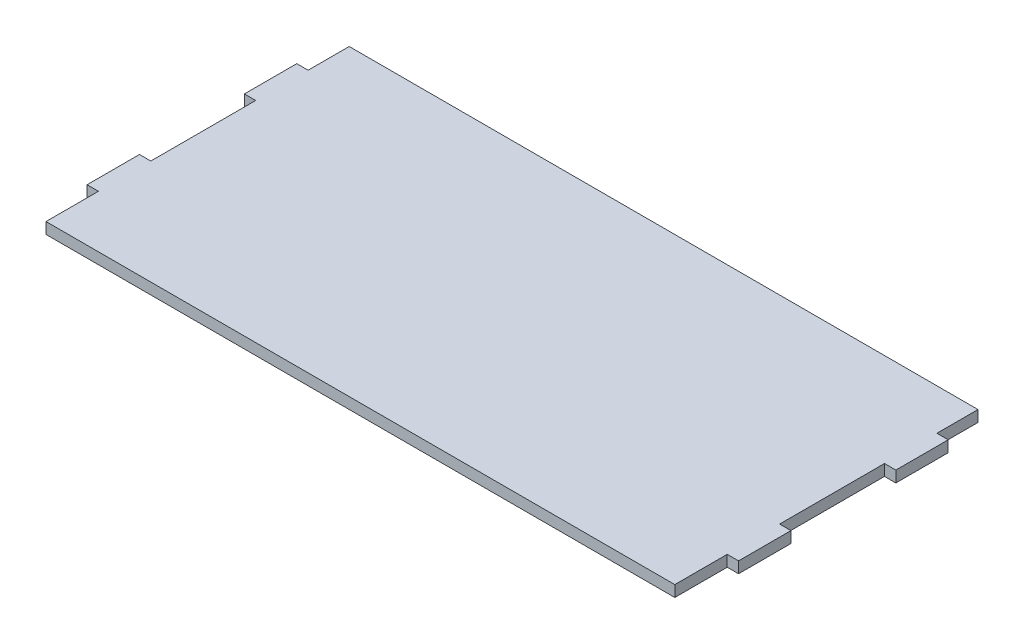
ISO-10303-21;
HEADER;
FILE_DESCRIPTION(('STEP AP214'),'2;1');
FILE_NAME('part.step','',(''),(''),'','','');
FILE_SCHEMA(('AUTOMOTIVE_DESIGN { 1 0 10303 214 1 1 1 1 }'));
ENDSEC;
DATA;
#1=APPLICATION_CONTEXT('core data for automotive mechanical design processes');
#2=APPLICATION_PROTOCOL_DEFINITION('international standard','automotive_design',2000,#1);
#3=PRODUCT_CONTEXT('',#1,'mechanical');
#4=PRODUCT('Part','Part','',(#3));
#5=PRODUCT_RELATED_PRODUCT_CATEGORY('part','',(#4));
#6=PRODUCT_DEFINITION_FORMATION('','',#4);
#7=PRODUCT_DEFINITION_CONTEXT('part definition',#1,'design');
#8=PRODUCT_DEFINITION('design','',#6,#7);
#9=PRODUCT_DEFINITION_SHAPE('','',#8);
#10=(LENGTH_UNIT() NAMED_UNIT(*) SI_UNIT(.MILLI.,.METRE.));
#11=(NAMED_UNIT(*) PLANE_ANGLE_UNIT() SI_UNIT($,.RADIAN.));
#12=(NAMED_UNIT(*) SI_UNIT($,.STERADIAN.) SOLID_ANGLE_UNIT());
#13=UNCERTAINTY_MEASURE_WITH_UNIT(LENGTH_MEASURE(1.E-05),#10,'distance_accuracy_value','');
#14=(GEOMETRIC_REPRESENTATION_CONTEXT(3) GLOBAL_UNCERTAINTY_ASSIGNED_CONTEXT((#13)) GLOBAL_UNIT_ASSIGNED_CONTEXT((#10,
#11,#12)) REPRESENTATION_CONTEXT('',''));
#15=CARTESIAN_POINT('',(0.,0.,0.));
#16=DIRECTION('',(0.,0.,1.));
#17=DIRECTION('',(1.,0.,0.));
#18=AXIS2_PLACEMENT_3D('',#15,#16,#17);
#19=CARTESIAN_POINT('',(0.332647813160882,16.30000042,-365.554762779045));
#20=DIRECTION('',(1.,0.,0.));
#21=DIRECTION('',(0.,0.,-1.));
#22=AXIS2_PLACEMENT_3D('',#19,#20,#21);
#23=PLANE('',#22);
#24=DIRECTION('',(0.,0.,1.));
#25=VECTOR('',#24,1.);
#26=CARTESIAN_POINT('',(0.332647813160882,0.,-365.554762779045));
#27=LINE('',#26,#25);
#28=CARTESIAN_POINT('',(0.332647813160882,0.,-365.554762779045));
#29=VERTEX_POINT('',#28);
#30=CARTESIAN_POINT('',(0.332647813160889,0.,-305.806810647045));
#31=VERTEX_POINT('',#30);
#32=EDGE_CURVE('E201',#29,#31,#27,.T.);
#33=ORIENTED_EDGE('',*,*,#32,.T.);
#34=DIRECTION('',(0.,-1.,0.));
#35=VECTOR('',#34,1.);
#36=CARTESIAN_POINT('',(0.332647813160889,16.30000042,-305.806810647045));
#37=LINE('',#36,#35);
#38=CARTESIAN_POINT('',(0.332647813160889,16.30000042,-305.806810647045));
#39=VERTEX_POINT('',#38);
#40=EDGE_CURVE('E11',#39,#31,#37,.T.);
#41=ORIENTED_EDGE('',*,*,#40,.F.);
#42=DIRECTION('',(0.,0.,1.));
#43=VECTOR('',#42,1.);
#44=CARTESIAN_POINT('',(0.332647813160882,16.30000042,-365.554762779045));
#45=LINE('',#44,#43);
#46=CARTESIAN_POINT('',(0.332647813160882,16.30000042,-365.554762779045));
#47=VERTEX_POINT('',#46);
#48=EDGE_CURVE('E239',#47,#39,#45,.T.);
#49=ORIENTED_EDGE('',*,*,#48,.F.);
#50=DIRECTION('',(0.,-1.,0.));
#51=VECTOR('',#50,1.);
#52=CARTESIAN_POINT('',(0.332647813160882,16.30000042,-365.554762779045));
#53=LINE('',#52,#51);
#54=EDGE_CURVE('E197',#47,#29,#53,.T.);
#55=ORIENTED_EDGE('',*,*,#54,.T.);
#56=EDGE_LOOP('',(#33,#41,#49,#55));
#57=FACE_BOUND('',#56,.T.);
#58=ADVANCED_FACE('F33',(#57),#23,.F.);
#59=CARTESIAN_POINT('',(0.332647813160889,16.30000042,-305.806810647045));
#60=DIRECTION('',(0.,0.,1.));
#61=DIRECTION('',(1.,0.,0.));
#62=AXIS2_PLACEMENT_3D('',#59,#60,#61);
#63=PLANE('',#62);
#64=DIRECTION('',(-1.,0.,0.));
#65=VECTOR('',#64,1.);
#66=CARTESIAN_POINT('',(0.332647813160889,0.,-305.806810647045));
#67=LINE('',#66,#65);
#68=CARTESIAN_POINT('',(-16.1451060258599,0.,-305.806810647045));
#69=VERTEX_POINT('',#68);
#70=EDGE_CURVE('E204',#31,#69,#67,.T.);
#71=ORIENTED_EDGE('',*,*,#70,.T.);
#72=DIRECTION('',(0.,-1.,0.));
#73=VECTOR('',#72,1.);
#74=CARTESIAN_POINT('',(-16.1451060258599,16.30000042,-305.806810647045));
#75=LINE('',#74,#73);
#76=CARTESIAN_POINT('',(-16.1451060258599,16.30000042,-305.806810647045));
#77=VERTEX_POINT('',#76);
#78=EDGE_CURVE('E41',#77,#69,#75,.T.);
#79=ORIENTED_EDGE('',*,*,#78,.F.);
#80=DIRECTION('',(-1.,0.,0.));
#81=VECTOR('',#80,1.);
#82=CARTESIAN_POINT('',(0.332647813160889,16.30000042,-305.806810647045));
#83=LINE('',#82,#81);
#84=EDGE_CURVE('E128',#39,#77,#83,.T.);
#85=ORIENTED_EDGE('',*,*,#84,.F.);
#86=ORIENTED_EDGE('',*,*,#40,.T.);
#87=EDGE_LOOP('',(#71,#79,#85,#86));
#88=FACE_BOUND('',#87,.T.);
#89=ADVANCED_FACE('F357',(#88),#63,.F.);
#90=CARTESIAN_POINT('',(-16.1451060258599,16.30000042,-305.806810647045));
#91=DIRECTION('',(1.,0.,0.));
#92=DIRECTION('',(0.,0.,-1.));
#93=AXIS2_PLACEMENT_3D('',#90,#91,#92);
#94=PLANE('',#93);
#95=DIRECTION('',(0.,0.,1.));
#96=VECTOR('',#95,1.);
#97=CARTESIAN_POINT('',(-16.1451060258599,0.,-305.806810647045));
#98=LINE('',#97,#96);
#99=CARTESIAN_POINT('',(-16.1451060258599,0.,-229.606810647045));
#100=VERTEX_POINT('',#99);
#101=EDGE_CURVE('E206',#69,#100,#98,.T.);
#102=ORIENTED_EDGE('',*,*,#101,.T.);
#103=DIRECTION('',(0.,-1.,0.));
#104=VECTOR('',#103,1.);
#105=CARTESIAN_POINT('',(-16.1451060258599,16.30000042,-229.606810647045));
#106=LINE('',#105,#104);
#107=CARTESIAN_POINT('',(-16.1451060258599,16.30000042,-229.606810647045));
#108=VERTEX_POINT('',#107);
#109=EDGE_CURVE('E282',#108,#100,#106,.T.);
#110=ORIENTED_EDGE('',*,*,#109,.F.);
#111=DIRECTION('',(0.,0.,1.));
#112=VECTOR('',#111,1.);
#113=CARTESIAN_POINT('',(-16.1451060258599,16.30000042,-305.806810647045));
#114=LINE('',#113,#112);
#115=EDGE_CURVE('E290',#77,#108,#114,.T.);
#116=ORIENTED_EDGE('',*,*,#115,.F.);
#117=ORIENTED_EDGE('',*,*,#78,.T.);
#118=EDGE_LOOP('',(#102,#110,#116,#117));
#119=FACE_BOUND('',#118,.T.);
#120=ADVANCED_FACE('F288',(#119),#94,.F.);
#121=CARTESIAN_POINT('',(-16.1451060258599,16.30000042,-229.606810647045));
#122=DIRECTION('',(0.,0.,-1.));
#123=DIRECTION('',(-1.,0.,0.));
#124=AXIS2_PLACEMENT_3D('',#121,#122,#123);
#125=PLANE('',#124);
#126=DIRECTION('',(1.,0.,0.));
#127=VECTOR('',#126,1.);
#128=CARTESIAN_POINT('',(-16.1451060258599,0.,-229.606810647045));
#129=LINE('',#128,#127);
#130=CARTESIAN_POINT('',(0.332647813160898,0.,-229.606810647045));
#131=VERTEX_POINT('',#130);
#132=EDGE_CURVE('E208',#100,#131,#129,.T.);
#133=ORIENTED_EDGE('',*,*,#132,.T.);
#134=DIRECTION('',(0.,-1.,0.));
#135=VECTOR('',#134,1.);
#136=CARTESIAN_POINT('',(0.332647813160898,16.30000042,-229.606810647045));
#137=LINE('',#136,#135);
#138=CARTESIAN_POINT('',(0.332647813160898,16.30000042,-229.606810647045));
#139=VERTEX_POINT('',#138);
#140=EDGE_CURVE('E279',#139,#131,#137,.T.);
#141=ORIENTED_EDGE('',*,*,#140,.F.);
#142=DIRECTION('',(1.,0.,0.));
#143=VECTOR('',#142,1.);
#144=CARTESIAN_POINT('',(-16.1451060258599,16.30000042,-229.606810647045));
#145=LINE('',#144,#143);
#146=EDGE_CURVE('E308',#108,#139,#145,.T.);
#147=ORIENTED_EDGE('',*,*,#146,.F.);
#148=ORIENTED_EDGE('',*,*,#109,.T.);
#149=EDGE_LOOP('',(#133,#141,#147,#148));
#150=FACE_BOUND('',#149,.T.);
#151=ADVANCED_FACE('F299',(#150),#125,.F.);
#152=CARTESIAN_POINT('',(0.332647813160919,16.30000042,-77.0721405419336));
#153=DIRECTION('',(1.,0.,0.));
#154=DIRECTION('',(0.,0.,-1.));
#155=AXIS2_PLACEMENT_3D('',#152,#153,#154);
#156=PLANE('',#155);
#157=DIRECTION('',(0.,0.,1.));
#158=VECTOR('',#157,1.);
#159=CARTESIAN_POINT('',(0.332647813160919,0.,-77.0721405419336));
#160=LINE('',#159,#158);
#161=CARTESIAN_POINT('',(0.332647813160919,0.,-77.0721405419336));
#162=VERTEX_POINT('',#161);
#163=EDGE_CURVE('E210',#131,#162,#160,.T.);
#164=ORIENTED_EDGE('',*,*,#163,.T.);
#165=DIRECTION('',(0.,-1.,0.));
#166=VECTOR('',#165,1.);
#167=CARTESIAN_POINT('',(0.332647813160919,16.30000042,-77.0721405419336));
#168=LINE('',#167,#166);
#169=CARTESIAN_POINT('',(0.332647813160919,16.30000042,-77.0721405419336));
#170=VERTEX_POINT('',#169);
#171=EDGE_CURVE('E276',#170,#162,#168,.T.);
#172=ORIENTED_EDGE('',*,*,#171,.F.);
#173=DIRECTION('',(0.,0.,1.));
#174=VECTOR('',#173,1.);
#175=CARTESIAN_POINT('',(0.332647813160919,16.30000042,-77.0721405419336));
#176=LINE('',#175,#174);
#177=EDGE_CURVE('E305',#139,#170,#176,.T.);
#178=ORIENTED_EDGE('',*,*,#177,.F.);
#179=ORIENTED_EDGE('',*,*,#140,.T.);
#180=EDGE_LOOP('',(#164,#172,#178,#179));
#181=FACE_BOUND('',#180,.T.);
#182=ADVANCED_FACE('F303',(#181),#156,.F.);
#183=CARTESIAN_POINT('',(-16.1495139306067,16.30000042,-77.0721405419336));
#184=DIRECTION('',(0.,0.,1.));
#185=DIRECTION('',(1.,0.,0.));
#186=AXIS2_PLACEMENT_3D('',#183,#184,#185);
#187=PLANE('',#186);
#188=DIRECTION('',(-1.,0.,0.));
#189=VECTOR('',#188,1.);
#190=CARTESIAN_POINT('',(-16.1495139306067,0.,-77.0721405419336));
#191=LINE('',#190,#189);
#192=CARTESIAN_POINT('',(-16.1495139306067,0.,-77.0721405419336));
#193=VERTEX_POINT('',#192);
#194=EDGE_CURVE('E212',#162,#193,#191,.T.);
#195=ORIENTED_EDGE('',*,*,#194,.T.);
#196=DIRECTION('',(0.,-1.,0.));
#197=VECTOR('',#196,1.);
#198=CARTESIAN_POINT('',(-16.1495139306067,16.30000042,-77.0721405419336));
#199=LINE('',#198,#197);
#200=CARTESIAN_POINT('',(-16.1495139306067,16.30000042,-77.0721405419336));
#201=VERTEX_POINT('',#200);
#202=EDGE_CURVE('E273',#201,#193,#199,.T.);
#203=ORIENTED_EDGE('',*,*,#202,.F.);
#204=DIRECTION('',(-1.,0.,0.));
#205=VECTOR('',#204,1.);
#206=CARTESIAN_POINT('',(-16.1495139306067,16.30000042,-77.0721405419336));
#207=LINE('',#206,#205);
#208=EDGE_CURVE('E307',#170,#201,#207,.T.);
#209=ORIENTED_EDGE('',*,*,#208,.F.);
#210=ORIENTED_EDGE('',*,*,#171,.T.);
#211=EDGE_LOOP('',(#195,#203,#209,#210));
#212=FACE_BOUND('',#211,.T.);
#213=ADVANCED_FACE('F370',(#212),#187,.F.);
#214=CARTESIAN_POINT('',(-16.1495139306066,16.30000042,-0.872140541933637));
#215=DIRECTION('',(1.,0.,0.));
#216=DIRECTION('',(0.,0.,-1.));
#217=AXIS2_PLACEMENT_3D('',#214,#215,#216);
#218=PLANE('',#217);
#219=DIRECTION('',(0.,0.,1.));
#220=VECTOR('',#219,1.);
#221=CARTESIAN_POINT('',(-16.1495139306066,0.,-0.872140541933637));
#222=LINE('',#221,#220);
#223=CARTESIAN_POINT('',(-16.1495139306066,0.,-0.872140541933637));
#224=VERTEX_POINT('',#223);
#225=EDGE_CURVE('E214',#193,#224,#222,.T.);
#226=ORIENTED_EDGE('',*,*,#225,.T.);
#227=DIRECTION('',(0.,-1.,0.));
#228=VECTOR('',#227,1.);
#229=CARTESIAN_POINT('',(-16.1495139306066,16.30000042,-0.872140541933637));
#230=LINE('',#229,#228);
#231=CARTESIAN_POINT('',(-16.1495139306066,16.30000042,-0.872140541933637));
#232=VERTEX_POINT('',#231);
#233=EDGE_CURVE('E270',#232,#224,#230,.T.);
#234=ORIENTED_EDGE('',*,*,#233,.F.);
#235=DIRECTION('',(0.,0.,1.));
#236=VECTOR('',#235,1.);
#237=CARTESIAN_POINT('',(-16.1495139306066,16.30000042,-0.872140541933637));
#238=LINE('',#237,#236);
#239=EDGE_CURVE('E310',#201,#232,#238,.T.);
#240=ORIENTED_EDGE('',*,*,#239,.F.);
#241=ORIENTED_EDGE('',*,*,#202,.T.);
#242=EDGE_LOOP('',(#226,#234,#240,#241));
#243=FACE_BOUND('',#242,.T.);
#244=ADVANCED_FACE('F373',(#243),#218,.F.);
#245=CARTESIAN_POINT('',(0.332647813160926,16.30000042,-0.872140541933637));
#246=DIRECTION('',(0.,0.,-1.));
#247=DIRECTION('',(-1.,0.,0.));
#248=AXIS2_PLACEMENT_3D('',#245,#246,#247);
#249=PLANE('',#248);
#250=DIRECTION('',(1.,0.,0.));
#251=VECTOR('',#250,1.);
#252=CARTESIAN_POINT('',(0.332647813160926,0.,-0.872140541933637));
#253=LINE('',#252,#251);
#254=CARTESIAN_POINT('',(0.332647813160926,0.,-0.872140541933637));
#255=VERTEX_POINT('',#254);
#256=EDGE_CURVE('E216',#224,#255,#253,.T.);
#257=ORIENTED_EDGE('',*,*,#256,.T.);
#258=DIRECTION('',(0.,-1.,0.));
#259=VECTOR('',#258,1.);
#260=CARTESIAN_POINT('',(0.332647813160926,16.30000042,-0.872140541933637));
#261=LINE('',#260,#259);
#262=CARTESIAN_POINT('',(0.332647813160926,16.30000042,-0.872140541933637));
#263=VERTEX_POINT('',#262);
#264=EDGE_CURVE('E267',#263,#255,#261,.T.);
#265=ORIENTED_EDGE('',*,*,#264,.F.);
#266=DIRECTION('',(1.,0.,0.));
#267=VECTOR('',#266,1.);
#268=CARTESIAN_POINT('',(0.332647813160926,16.30000042,-0.872140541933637));
#269=LINE('',#268,#267);
#270=EDGE_CURVE('E316',#232,#263,#269,.T.);
#271=ORIENTED_EDGE('',*,*,#270,.F.);
#272=ORIENTED_EDGE('',*,*,#233,.T.);
#273=EDGE_LOOP('',(#257,#265,#271,#272));
#274=FACE_BOUND('',#273,.T.);
#275=ADVANCED_FACE('F377',(#274),#249,.F.);
#276=CARTESIAN_POINT('',(0.332647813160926,16.30000042,-0.872140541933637));
#277=DIRECTION('',(1.,0.,0.));
#278=DIRECTION('',(0.,0.,-1.));
#279=AXIS2_PLACEMENT_3D('',#276,#277,#278);
#280=PLANE('',#279);
#281=DIRECTION('',(0.,0.,1.));
#282=VECTOR('',#281,1.);
#283=CARTESIAN_POINT('',(0.332647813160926,0.,-0.872140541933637));
#284=LINE('',#283,#282);
#285=CARTESIAN_POINT('',(0.332647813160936,0.,75.3452367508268));
#286=VERTEX_POINT('',#285);
#287=EDGE_CURVE('E218',#255,#286,#284,.T.);
#288=ORIENTED_EDGE('',*,*,#287,.T.);
#289=DIRECTION('',(0.,-1.,0.));
#290=VECTOR('',#289,1.);
#291=CARTESIAN_POINT('',(0.332647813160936,16.30000042,75.3452367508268));
#292=LINE('',#291,#290);
#293=CARTESIAN_POINT('',(0.332647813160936,16.30000042,75.3452367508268));
#294=VERTEX_POINT('',#293);
#295=EDGE_CURVE('E264',#294,#286,#292,.T.);
#296=ORIENTED_EDGE('',*,*,#295,.F.);
#297=DIRECTION('',(0.,0.,1.));
#298=VECTOR('',#297,1.);
#299=CARTESIAN_POINT('',(0.332647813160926,16.30000042,-0.872140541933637));
#300=LINE('',#299,#298);
#301=EDGE_CURVE('E318',#263,#294,#300,.T.);
#302=ORIENTED_EDGE('',*,*,#301,.F.);
#303=ORIENTED_EDGE('',*,*,#264,.T.);
#304=EDGE_LOOP('',(#288,#296,#302,#303));
#305=FACE_BOUND('',#304,.T.);
#306=ADVANCED_FACE('F381',(#305),#280,.F.);
#307=CARTESIAN_POINT('',(0.332647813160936,16.30000042,75.3452367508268));
#308=DIRECTION('',(0.,0.,-1.));
#309=DIRECTION('',(-1.,0.,0.));
#310=AXIS2_PLACEMENT_3D('',#307,#308,#309);
#311=PLANE('',#310);
#312=DIRECTION('',(1.,0.,0.));
#313=VECTOR('',#312,1.);
#314=CARTESIAN_POINT('',(0.332647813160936,0.,75.3452367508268));
#315=LINE('',#314,#313);
#316=CARTESIAN_POINT('',(914.732647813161,0.,75.3452367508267));
#317=VERTEX_POINT('',#316);
#318=EDGE_CURVE('E220',#286,#317,#315,.T.);
#319=ORIENTED_EDGE('',*,*,#318,.T.);
#320=DIRECTION('',(0.,-1.,0.));
#321=VECTOR('',#320,1.);
#322=CARTESIAN_POINT('',(914.732647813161,16.30000042,75.3452367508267));
#323=LINE('',#322,#321);
#324=CARTESIAN_POINT('',(914.732647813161,16.30000042,75.3452367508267));
#325=VERTEX_POINT('',#324);
#326=EDGE_CURVE('E261',#325,#317,#323,.T.);
#327=ORIENTED_EDGE('',*,*,#326,.F.);
#328=DIRECTION('',(1.,0.,0.));
#329=VECTOR('',#328,1.);
#330=CARTESIAN_POINT('',(0.332647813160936,16.30000042,75.3452367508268));
#331=LINE('',#330,#329);
#332=EDGE_CURVE('E320',#294,#325,#331,.T.);
#333=ORIENTED_EDGE('',*,*,#332,.F.);
#334=ORIENTED_EDGE('',*,*,#295,.T.);
#335=EDGE_LOOP('',(#319,#327,#333,#334));
#336=FACE_BOUND('',#335,.T.);
#337=ADVANCED_FACE('F385',(#336),#311,.F.);
#338=CARTESIAN_POINT('',(914.732647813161,16.30000042,-0.872140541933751));
#339=DIRECTION('',(-1.,0.,0.));
#340=DIRECTION('',(0.,0.,1.));
#341=AXIS2_PLACEMENT_3D('',#338,#339,#340);
#342=PLANE('',#341);
#343=DIRECTION('',(0.,0.,-1.));
#344=VECTOR('',#343,1.);
#345=CARTESIAN_POINT('',(914.732647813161,0.,-0.872140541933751));
#346=LINE('',#345,#344);
#347=CARTESIAN_POINT('',(914.732647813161,0.,-0.872140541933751));
#348=VERTEX_POINT('',#347);
#349=EDGE_CURVE('E222',#317,#348,#346,.T.);
#350=ORIENTED_EDGE('',*,*,#349,.T.);
#351=DIRECTION('',(0.,-1.,0.));
#352=VECTOR('',#351,1.);
#353=CARTESIAN_POINT('',(914.732647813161,16.30000042,-0.872140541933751));
#354=LINE('',#353,#352);
#355=CARTESIAN_POINT('',(914.732647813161,16.30000042,-0.872140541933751));
#356=VERTEX_POINT('',#355);
#357=EDGE_CURVE('E258',#356,#348,#354,.T.);
#358=ORIENTED_EDGE('',*,*,#357,.F.);
#359=DIRECTION('',(0.,0.,-1.));
#360=VECTOR('',#359,1.);
#361=CARTESIAN_POINT('',(914.732647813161,16.30000042,-0.872140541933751));
#362=LINE('',#361,#360);
#363=EDGE_CURVE('E322',#325,#356,#362,.T.);
#364=ORIENTED_EDGE('',*,*,#363,.F.);
#365=ORIENTED_EDGE('',*,*,#326,.T.);
#366=EDGE_LOOP('',(#350,#358,#364,#365));
#367=FACE_BOUND('',#366,.T.);
#368=ADVANCED_FACE('F389',(#367),#342,.F.);
#369=CARTESIAN_POINT('',(914.732647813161,16.30000042,-0.872140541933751));
#370=DIRECTION('',(0.,0.,-1.));
#371=DIRECTION('',(-1.,0.,0.));
#372=AXIS2_PLACEMENT_3D('',#369,#370,#371);
#373=PLANE('',#372);
#374=DIRECTION('',(1.,0.,0.));
#375=VECTOR('',#374,1.);
#376=CARTESIAN_POINT('',(914.732647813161,0.,-0.872140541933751));
#377=LINE('',#376,#375);
#378=CARTESIAN_POINT('',(931.214809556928,0.,-0.872140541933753));
#379=VERTEX_POINT('',#378);
#380=EDGE_CURVE('E224',#348,#379,#377,.T.);
#381=ORIENTED_EDGE('',*,*,#380,.T.);
#382=DIRECTION('',(0.,-1.,0.));
#383=VECTOR('',#382,1.);
#384=CARTESIAN_POINT('',(931.214809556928,16.30000042,-0.872140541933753));
#385=LINE('',#384,#383);
#386=CARTESIAN_POINT('',(931.214809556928,16.30000042,-0.872140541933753));
#387=VERTEX_POINT('',#386);
#388=EDGE_CURVE('E255',#387,#379,#385,.T.);
#389=ORIENTED_EDGE('',*,*,#388,.F.);
#390=DIRECTION('',(1.,0.,0.));
#391=VECTOR('',#390,1.);
#392=CARTESIAN_POINT('',(914.732647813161,16.30000042,-0.872140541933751));
#393=LINE('',#392,#391);
#394=EDGE_CURVE('E324',#356,#387,#393,.T.);
#395=ORIENTED_EDGE('',*,*,#394,.F.);
#396=ORIENTED_EDGE('',*,*,#357,.T.);
#397=EDGE_LOOP('',(#381,#389,#395,#396));
#398=FACE_BOUND('',#397,.T.);
#399=ADVANCED_FACE('F393',(#398),#373,.F.);
#400=CARTESIAN_POINT('',(931.214809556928,16.30000042,-0.872140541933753));
#401=DIRECTION('',(-1.,0.,0.));
#402=DIRECTION('',(0.,0.,1.));
#403=AXIS2_PLACEMENT_3D('',#400,#401,#402);
#404=PLANE('',#403);
#405=DIRECTION('',(0.,0.,-1.));
#406=VECTOR('',#405,1.);
#407=CARTESIAN_POINT('',(931.214809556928,0.,-0.872140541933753));
#408=LINE('',#407,#406);
#409=CARTESIAN_POINT('',(931.214809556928,0.,-77.0721405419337));
#410=VERTEX_POINT('',#409);
#411=EDGE_CURVE('E226',#379,#410,#408,.T.);
#412=ORIENTED_EDGE('',*,*,#411,.T.);
#413=DIRECTION('',(0.,-1.,0.));
#414=VECTOR('',#413,1.);
#415=CARTESIAN_POINT('',(931.214809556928,16.30000042,-77.0721405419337));
#416=LINE('',#415,#414);
#417=CARTESIAN_POINT('',(931.214809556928,16.30000042,-77.0721405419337));
#418=VERTEX_POINT('',#417);
#419=EDGE_CURVE('E252',#418,#410,#416,.T.);
#420=ORIENTED_EDGE('',*,*,#419,.F.);
#421=DIRECTION('',(0.,0.,-1.));
#422=VECTOR('',#421,1.);
#423=CARTESIAN_POINT('',(931.214809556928,16.30000042,-0.872140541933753));
#424=LINE('',#423,#422);
#425=EDGE_CURVE('E326',#387,#418,#424,.T.);
#426=ORIENTED_EDGE('',*,*,#425,.F.);
#427=ORIENTED_EDGE('',*,*,#388,.T.);
#428=EDGE_LOOP('',(#412,#420,#426,#427));
#429=FACE_BOUND('',#428,.T.);
#430=ADVANCED_FACE('F397',(#429),#404,.F.);
#431=CARTESIAN_POINT('',(931.214809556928,16.30000042,-77.0721405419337));
#432=DIRECTION('',(0.,0.,1.));
#433=DIRECTION('',(1.,0.,0.));
#434=AXIS2_PLACEMENT_3D('',#431,#432,#433);
#435=PLANE('',#434);
#436=DIRECTION('',(-1.,0.,0.));
#437=VECTOR('',#436,1.);
#438=CARTESIAN_POINT('',(931.214809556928,0.,-77.0721405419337));
#439=LINE('',#438,#437);
#440=CARTESIAN_POINT('',(914.732647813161,0.,-77.0721405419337));
#441=VERTEX_POINT('',#440);
#442=EDGE_CURVE('E228',#410,#441,#439,.T.);
#443=ORIENTED_EDGE('',*,*,#442,.T.);
#444=DIRECTION('',(0.,-1.,0.));
#445=VECTOR('',#444,1.);
#446=CARTESIAN_POINT('',(914.732647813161,16.30000042,-77.0721405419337));
#447=LINE('',#446,#445);
#448=CARTESIAN_POINT('',(914.732647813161,16.30000042,-77.0721405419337));
#449=VERTEX_POINT('',#448);
#450=EDGE_CURVE('E249',#449,#441,#447,.T.);
#451=ORIENTED_EDGE('',*,*,#450,.F.);
#452=DIRECTION('',(-1.,0.,0.));
#453=VECTOR('',#452,1.);
#454=CARTESIAN_POINT('',(931.214809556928,16.30000042,-77.0721405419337));
#455=LINE('',#454,#453);
#456=EDGE_CURVE('E328',#418,#449,#455,.T.);
#457=ORIENTED_EDGE('',*,*,#456,.F.);
#458=ORIENTED_EDGE('',*,*,#419,.T.);
#459=EDGE_LOOP('',(#443,#451,#457,#458));
#460=FACE_BOUND('',#459,.T.);
#461=ADVANCED_FACE('F401',(#460),#435,.F.);
#462=CARTESIAN_POINT('',(914.732647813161,16.30000042,-229.606810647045));
#463=DIRECTION('',(-1.,0.,0.));
#464=DIRECTION('',(0.,0.,1.));
#465=AXIS2_PLACEMENT_3D('',#462,#463,#464);
#466=PLANE('',#465);
#467=DIRECTION('',(0.,0.,-1.));
#468=VECTOR('',#467,1.);
#469=CARTESIAN_POINT('',(914.732647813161,0.,-229.606810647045));
#470=LINE('',#469,#468);
#471=CARTESIAN_POINT('',(914.732647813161,0.,-229.606810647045));
#472=VERTEX_POINT('',#471);
#473=EDGE_CURVE('E230',#441,#472,#470,.T.);
#474=ORIENTED_EDGE('',*,*,#473,.T.);
#475=DIRECTION('',(0.,-1.,0.));
#476=VECTOR('',#475,1.);
#477=CARTESIAN_POINT('',(914.732647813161,16.30000042,-229.606810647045));
#478=LINE('',#477,#476);
#479=CARTESIAN_POINT('',(914.732647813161,16.30000042,-229.606810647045));
#480=VERTEX_POINT('',#479);
#481=EDGE_CURVE('E246',#480,#472,#478,.T.);
#482=ORIENTED_EDGE('',*,*,#481,.F.);
#483=DIRECTION('',(0.,0.,-1.));
#484=VECTOR('',#483,1.);
#485=CARTESIAN_POINT('',(914.732647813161,16.30000042,-229.606810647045));
#486=LINE('',#485,#484);
#487=EDGE_CURVE('E330',#449,#480,#486,.T.);
#488=ORIENTED_EDGE('',*,*,#487,.F.);
#489=ORIENTED_EDGE('',*,*,#450,.T.);
#490=EDGE_LOOP('',(#474,#482,#488,#489));
#491=FACE_BOUND('',#490,.T.);
#492=ADVANCED_FACE('F405',(#491),#466,.F.);
#493=CARTESIAN_POINT('',(931.210401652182,16.30000042,-229.606810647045));
#494=DIRECTION('',(0.,0.,-1.));
#495=DIRECTION('',(-1.,0.,0.));
#496=AXIS2_PLACEMENT_3D('',#493,#494,#495);
#497=PLANE('',#496);
#498=DIRECTION('',(1.,0.,0.));
#499=VECTOR('',#498,1.);
#500=CARTESIAN_POINT('',(931.210401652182,0.,-229.606810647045));
#501=LINE('',#500,#499);
#502=CARTESIAN_POINT('',(931.210401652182,0.,-229.606810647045));
#503=VERTEX_POINT('',#502);
#504=EDGE_CURVE('E232',#472,#503,#501,.T.);
#505=ORIENTED_EDGE('',*,*,#504,.T.);
#506=DIRECTION('',(0.,-1.,0.));
#507=VECTOR('',#506,1.);
#508=CARTESIAN_POINT('',(931.210401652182,16.30000042,-229.606810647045));
#509=LINE('',#508,#507);
#510=CARTESIAN_POINT('',(931.210401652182,16.30000042,-229.606810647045));
#511=VERTEX_POINT('',#510);
#512=EDGE_CURVE('E243',#511,#503,#509,.T.);
#513=ORIENTED_EDGE('',*,*,#512,.F.);
#514=DIRECTION('',(1.,0.,0.));
#515=VECTOR('',#514,1.);
#516=CARTESIAN_POINT('',(931.210401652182,16.30000042,-229.606810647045));
#517=LINE('',#516,#515);
#518=EDGE_CURVE('E332',#480,#511,#517,.T.);
#519=ORIENTED_EDGE('',*,*,#518,.F.);
#520=ORIENTED_EDGE('',*,*,#481,.T.);
#521=EDGE_LOOP('',(#505,#513,#519,#520));
#522=FACE_BOUND('',#521,.T.);
#523=ADVANCED_FACE('F338',(#522),#497,.F.);
#524=CARTESIAN_POINT('',(931.210401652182,16.30000042,-305.806810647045));
#525=DIRECTION('',(-1.,0.,0.));
#526=DIRECTION('',(0.,0.,1.));
#527=AXIS2_PLACEMENT_3D('',#524,#525,#526);
#528=PLANE('',#527);
#529=DIRECTION('',(0.,0.,-1.));
#530=VECTOR('',#529,1.);
#531=CARTESIAN_POINT('',(931.210401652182,0.,-305.806810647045));
#532=LINE('',#531,#530);
#533=CARTESIAN_POINT('',(931.210401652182,0.,-305.806810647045));
#534=VERTEX_POINT('',#533);
#535=EDGE_CURVE('E234',#503,#534,#532,.T.);
#536=ORIENTED_EDGE('',*,*,#535,.T.);
#537=DIRECTION('',(0.,-1.,0.));
#538=VECTOR('',#537,1.);
#539=CARTESIAN_POINT('',(931.210401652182,16.30000042,-305.806810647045));
#540=LINE('',#539,#538);
#541=CARTESIAN_POINT('',(931.210401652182,16.30000042,-305.806810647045));
#542=VERTEX_POINT('',#541);
#543=EDGE_CURVE('E192',#542,#534,#540,.T.);
#544=ORIENTED_EDGE('',*,*,#543,.F.);
#545=DIRECTION('',(0.,0.,-1.));
#546=VECTOR('',#545,1.);
#547=CARTESIAN_POINT('',(931.210401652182,16.30000042,-305.806810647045));
#548=LINE('',#547,#546);
#549=EDGE_CURVE('E183',#511,#542,#548,.T.);
#550=ORIENTED_EDGE('',*,*,#549,.F.);
#551=ORIENTED_EDGE('',*,*,#512,.T.);
#552=EDGE_LOOP('',(#536,#544,#550,#551));
#553=FACE_BOUND('',#552,.T.);
#554=ADVANCED_FACE('F342',(#553),#528,.F.);
#555=CARTESIAN_POINT('',(914.732647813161,16.30000042,-305.806810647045));
#556=DIRECTION('',(0.,0.,1.));
#557=DIRECTION('',(1.,0.,0.));
#558=AXIS2_PLACEMENT_3D('',#555,#556,#557);
#559=PLANE('',#558);
#560=DIRECTION('',(-1.,0.,0.));
#561=VECTOR('',#560,1.);
#562=CARTESIAN_POINT('',(914.732647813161,0.,-305.806810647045));
#563=LINE('',#562,#561);
#564=CARTESIAN_POINT('',(914.732647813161,0.,-305.806810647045));
#565=VERTEX_POINT('',#564);
#566=EDGE_CURVE('E191',#534,#565,#563,.T.);
#567=ORIENTED_EDGE('',*,*,#566,.T.);
#568=DIRECTION('',(0.,-1.,0.));
#569=VECTOR('',#568,1.);
#570=CARTESIAN_POINT('',(914.732647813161,16.30000042,-305.806810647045));
#571=LINE('',#570,#569);
#572=CARTESIAN_POINT('',(914.732647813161,16.30000042,-305.806810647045));
#573=VERTEX_POINT('',#572);
#574=EDGE_CURVE('E188',#573,#565,#571,.T.);
#575=ORIENTED_EDGE('',*,*,#574,.F.);
#576=DIRECTION('',(-1.,0.,0.));
#577=VECTOR('',#576,1.);
#578=CARTESIAN_POINT('',(914.732647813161,16.30000042,-305.806810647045));
#579=LINE('',#578,#577);
#580=EDGE_CURVE('E177',#542,#573,#579,.T.);
#581=ORIENTED_EDGE('',*,*,#580,.F.);
#582=ORIENTED_EDGE('',*,*,#543,.T.);
#583=EDGE_LOOP('',(#567,#575,#581,#582));
#584=FACE_BOUND('',#583,.T.);
#585=ADVANCED_FACE('F189',(#584),#559,.F.);
#586=CARTESIAN_POINT('',(914.732647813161,16.30000042,-365.554762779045));
#587=DIRECTION('',(-1.,0.,0.));
#588=DIRECTION('',(0.,0.,1.));
#589=AXIS2_PLACEMENT_3D('',#586,#587,#588);
#590=PLANE('',#589);
#591=DIRECTION('',(0.,0.,-1.));
#592=VECTOR('',#591,1.);
#593=CARTESIAN_POINT('',(914.732647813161,0.,-365.554762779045));
#594=LINE('',#593,#592);
#595=CARTESIAN_POINT('',(914.732647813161,0.,-365.554762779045));
#596=VERTEX_POINT('',#595);
#597=EDGE_CURVE('E114',#565,#596,#594,.T.);
#598=ORIENTED_EDGE('',*,*,#597,.T.);
#599=DIRECTION('',(0.,-1.,0.));
#600=VECTOR('',#599,1.);
#601=CARTESIAN_POINT('',(914.732647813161,16.30000042,-365.554762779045));
#602=LINE('',#601,#600);
#603=CARTESIAN_POINT('',(914.732647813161,16.30000042,-365.554762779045));
#604=VERTEX_POINT('',#603);
#605=EDGE_CURVE('E193',#604,#596,#602,.T.);
#606=ORIENTED_EDGE('',*,*,#605,.F.);
#607=DIRECTION('',(0.,0.,-1.));
#608=VECTOR('',#607,1.);
#609=CARTESIAN_POINT('',(914.732647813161,16.30000042,-365.554762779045));
#610=LINE('',#609,#608);
#611=EDGE_CURVE('E181',#573,#604,#610,.T.);
#612=ORIENTED_EDGE('',*,*,#611,.F.);
#613=ORIENTED_EDGE('',*,*,#574,.T.);
#614=EDGE_LOOP('',(#598,#606,#612,#613));
#615=FACE_BOUND('',#614,.T.);
#616=ADVANCED_FACE('F195',(#615),#590,.F.);
#617=CARTESIAN_POINT('',(0.332647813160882,16.30000042,-365.554762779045));
#618=DIRECTION('',(0.,0.,1.));
#619=DIRECTION('',(1.,0.,0.));
#620=AXIS2_PLACEMENT_3D('',#617,#618,#619);
#621=PLANE('',#620);
#622=DIRECTION('',(-1.,0.,0.));
#623=VECTOR('',#622,1.);
#624=CARTESIAN_POINT('',(0.332647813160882,0.,-365.554762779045));
#625=LINE('',#624,#623);
#626=EDGE_CURVE('E120',#596,#29,#625,.T.);
#627=ORIENTED_EDGE('',*,*,#626,.T.);
#628=ORIENTED_EDGE('',*,*,#54,.F.);
#629=DIRECTION('',(-1.,0.,0.));
#630=VECTOR('',#629,1.);
#631=CARTESIAN_POINT('',(0.332647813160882,16.30000042,-365.554762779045));
#632=LINE('',#631,#630);
#633=EDGE_CURVE('E49',#604,#47,#632,.T.);
#634=ORIENTED_EDGE('',*,*,#633,.F.);
#635=ORIENTED_EDGE('',*,*,#605,.T.);
#636=EDGE_LOOP('',(#627,#628,#634,#635));
#637=FACE_BOUND('',#636,.T.);
#638=ADVANCED_FACE('F346',(#637),#621,.F.);
#639=CARTESIAN_POINT('',(0.,16.30000042,0.));
#640=DIRECTION('',(0.,-1.,0.));
#641=DIRECTION('',(0.,0.,-1.));
#642=AXIS2_PLACEMENT_3D('',#639,#640,#641);
#643=PLANE('',#642);
#644=ORIENTED_EDGE('',*,*,#48,.T.);
#645=ORIENTED_EDGE('',*,*,#84,.T.);
#646=ORIENTED_EDGE('',*,*,#115,.T.);
#647=ORIENTED_EDGE('',*,*,#146,.T.);
#648=ORIENTED_EDGE('',*,*,#177,.T.);
#649=ORIENTED_EDGE('',*,*,#208,.T.);
#650=ORIENTED_EDGE('',*,*,#239,.T.);
#651=ORIENTED_EDGE('',*,*,#270,.T.);
#652=ORIENTED_EDGE('',*,*,#301,.T.);
#653=ORIENTED_EDGE('',*,*,#332,.T.);
#654=ORIENTED_EDGE('',*,*,#363,.T.);
#655=ORIENTED_EDGE('',*,*,#394,.T.);
#656=ORIENTED_EDGE('',*,*,#425,.T.);
#657=ORIENTED_EDGE('',*,*,#456,.T.);
#658=ORIENTED_EDGE('',*,*,#487,.T.);
#659=ORIENTED_EDGE('',*,*,#518,.T.);
#660=ORIENTED_EDGE('',*,*,#549,.T.);
#661=ORIENTED_EDGE('',*,*,#580,.T.);
#662=ORIENTED_EDGE('',*,*,#611,.T.);
#663=ORIENTED_EDGE('',*,*,#633,.T.);
#664=EDGE_LOOP('',(#644,#645,#646,#647,#648,#649,#650,#651,#652,#653,#654,#655,#656,#657,#658,
#659,#660,#661,#662,#663));
#665=FACE_BOUND('',#664,.T.);
#666=ADVANCED_FACE('F179',(#665),#643,.F.);
#667=CARTESIAN_POINT('',(0.,0.,0.));
#668=DIRECTION('',(0.,-1.,0.));
#669=DIRECTION('',(0.,0.,-1.));
#670=AXIS2_PLACEMENT_3D('',#667,#668,#669);
#671=PLANE('',#670);
#672=ORIENTED_EDGE('',*,*,#32,.F.);
#673=ORIENTED_EDGE('',*,*,#626,.F.);
#674=ORIENTED_EDGE('',*,*,#597,.F.);
#675=ORIENTED_EDGE('',*,*,#566,.F.);
#676=ORIENTED_EDGE('',*,*,#535,.F.);
#677=ORIENTED_EDGE('',*,*,#504,.F.);
#678=ORIENTED_EDGE('',*,*,#473,.F.);
#679=ORIENTED_EDGE('',*,*,#442,.F.);
#680=ORIENTED_EDGE('',*,*,#411,.F.);
#681=ORIENTED_EDGE('',*,*,#380,.F.);
#682=ORIENTED_EDGE('',*,*,#349,.F.);
#683=ORIENTED_EDGE('',*,*,#318,.F.);
#684=ORIENTED_EDGE('',*,*,#287,.F.);
#685=ORIENTED_EDGE('',*,*,#256,.F.);
#686=ORIENTED_EDGE('',*,*,#225,.F.);
#687=ORIENTED_EDGE('',*,*,#194,.F.);
#688=ORIENTED_EDGE('',*,*,#163,.F.);
#689=ORIENTED_EDGE('',*,*,#132,.F.);
#690=ORIENTED_EDGE('',*,*,#101,.F.);
#691=ORIENTED_EDGE('',*,*,#70,.F.);
#692=EDGE_LOOP('',(#672,#673,#674,#675,#676,#677,#678,#679,#680,#681,#682,#683,#684,#685,#686,
#687,#688,#689,#690,#691));
#693=FACE_BOUND('',#692,.T.);
#694=ADVANCED_FACE('F294',(#693),#671,.T.);
#695=CLOSED_SHELL('',(#58,#89,#120,#151,#182,#213,#244,#275,#306,#337,#368,#399,#430,#461,#492,
#523,#554,#585,#616,#638,#666,#694));
#696=MANIFOLD_SOLID_BREP('B2',#695);
#697=ADVANCED_BREP_SHAPE_REPRESENTATION('',(#18,#696),#14);
#698=SHAPE_DEFINITION_REPRESENTATION(#9,#697);
ENDSEC;
END-ISO-10303-21;
